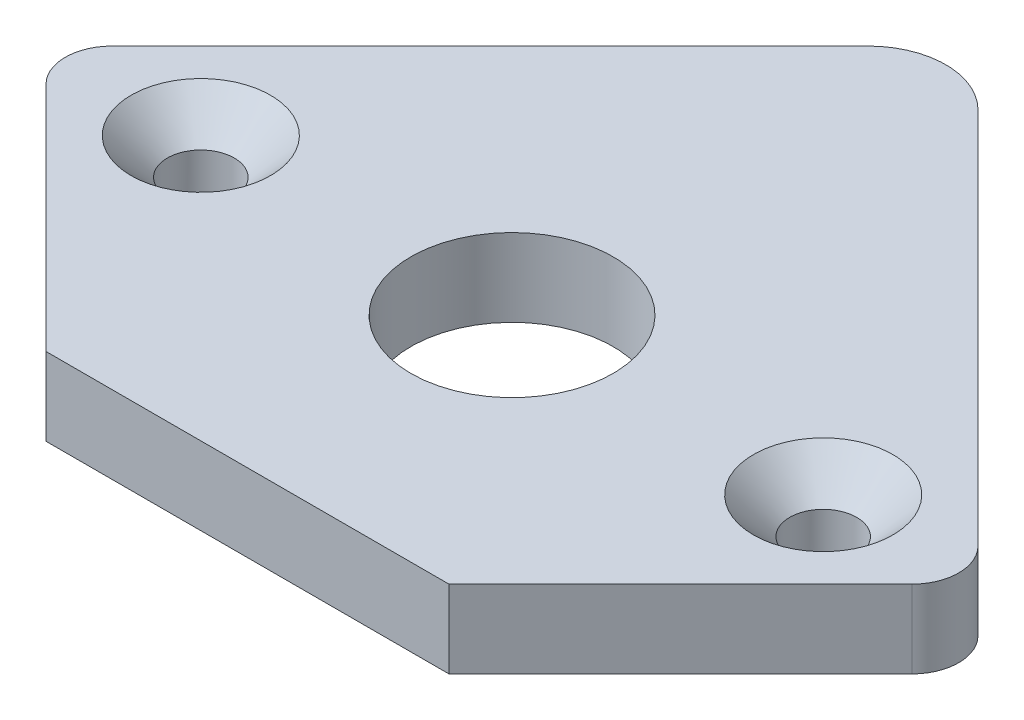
ISO-10303-21;
HEADER;
FILE_DESCRIPTION(('STEP AP214'),'2;1');
FILE_NAME('part.step','',(''),(''),'','','');
FILE_SCHEMA(('AUTOMOTIVE_DESIGN { 1 0 10303 214 1 1 1 1 }'));
ENDSEC;
DATA;
#1=APPLICATION_CONTEXT('core data for automotive mechanical design processes');
#2=APPLICATION_PROTOCOL_DEFINITION('international standard','automotive_design',2000,#1);
#3=PRODUCT_CONTEXT('',#1,'mechanical');
#4=PRODUCT('Part','Part','',(#3));
#5=PRODUCT_RELATED_PRODUCT_CATEGORY('part','',(#4));
#6=PRODUCT_DEFINITION_FORMATION('','',#4);
#7=PRODUCT_DEFINITION_CONTEXT('part definition',#1,'design');
#8=PRODUCT_DEFINITION('design','',#6,#7);
#9=PRODUCT_DEFINITION_SHAPE('','',#8);
#10=(LENGTH_UNIT() NAMED_UNIT(*) SI_UNIT(.MILLI.,.METRE.));
#11=(NAMED_UNIT(*) PLANE_ANGLE_UNIT() SI_UNIT($,.RADIAN.));
#12=(NAMED_UNIT(*) SI_UNIT($,.STERADIAN.) SOLID_ANGLE_UNIT());
#13=UNCERTAINTY_MEASURE_WITH_UNIT(LENGTH_MEASURE(1.E-05),#10,'distance_accuracy_value','');
#14=(GEOMETRIC_REPRESENTATION_CONTEXT(3) GLOBAL_UNCERTAINTY_ASSIGNED_CONTEXT((#13)) GLOBAL_UNIT_ASSIGNED_CONTEXT((#10,
#11,#12)) REPRESENTATION_CONTEXT('',''));
#15=CARTESIAN_POINT('',(0.,0.,0.));
#16=DIRECTION('',(0.,0.,1.));
#17=DIRECTION('',(1.,0.,0.));
#18=AXIS2_PLACEMENT_3D('',#15,#16,#17);
#19=CARTESIAN_POINT('',(-25.7073593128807,2.5,0.));
#20=DIRECTION('',(0.,-1.,0.));
#21=DIRECTION('',(0.,0.,-1.));
#22=AXIS2_PLACEMENT_3D('',#19,#20,#21);
#23=PLANE('',#22);
#24=CARTESIAN_POINT('',(20.,2.5,0.));
#25=DIRECTION('',(0.,1.,0.));
#26=DIRECTION('',(0.,0.,1.));
#27=AXIS2_PLACEMENT_3D('',#24,#25,#26);
#28=CIRCLE('',#27,4.48);
#29=CARTESIAN_POINT('',(20.,2.5,4.48));
#30=VERTEX_POINT('',#29);
#31=EDGE_CURVE('E247',#30,#30,#28,.T.);
#32=ORIENTED_EDGE('',*,*,#31,.F.);
#33=EDGE_LOOP('',(#32));
#34=FACE_BOUND('',#33,.T.);
#35=CARTESIAN_POINT('',(-20.,2.5,0.));
#36=DIRECTION('',(0.,1.,0.));
#37=DIRECTION('',(0.,0.,1.));
#38=AXIS2_PLACEMENT_3D('',#35,#36,#37);
#39=CIRCLE('',#38,4.48);
#40=CARTESIAN_POINT('',(-20.,2.5,4.48));
#41=VERTEX_POINT('',#40);
#42=EDGE_CURVE('E171',#41,#41,#39,.T.);
#43=ORIENTED_EDGE('',*,*,#42,.F.);
#44=EDGE_LOOP('',(#43));
#45=FACE_BOUND('',#44,.T.);
#46=CARTESIAN_POINT('',(-25.7073593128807,2.5,0.));
#47=DIRECTION('',(0.,1.,0.));
#48=DIRECTION('',(0.,0.,-1.));
#49=AXIS2_PLACEMENT_3D('',#46,#47,#48);
#50=CIRCLE('',#49,3.);
#51=CARTESIAN_POINT('',(-27.8286796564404,2.5,-2.12132034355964));
#52=VERTEX_POINT('',#51);
#53=CARTESIAN_POINT('',(-27.8286796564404,2.5,2.12132034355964));
#54=VERTEX_POINT('',#53);
#55=EDGE_CURVE('E151',#52,#54,#50,.T.);
#56=ORIENTED_EDGE('',*,*,#55,.T.);
#57=DIRECTION('',(0.707106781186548,0.,0.707106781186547));
#58=VECTOR('',#57,1.);
#59=CARTESIAN_POINT('',(-12.95,2.5,17.));
#60=LINE('',#59,#58);
#61=CARTESIAN_POINT('',(-12.95,2.5,17.));
#62=VERTEX_POINT('',#61);
#63=EDGE_CURVE('E99',#54,#62,#60,.T.);
#64=ORIENTED_EDGE('',*,*,#63,.T.);
#65=DIRECTION('',(1.,0.,0.));
#66=VECTOR('',#65,1.);
#67=CARTESIAN_POINT('',(12.95,2.5,17.));
#68=LINE('',#67,#66);
#69=CARTESIAN_POINT('',(12.95,2.5,17.));
#70=VERTEX_POINT('',#69);
#71=EDGE_CURVE('E183',#62,#70,#68,.T.);
#72=ORIENTED_EDGE('',*,*,#71,.T.);
#73=DIRECTION('',(0.707106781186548,0.,-0.707106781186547));
#74=VECTOR('',#73,1.);
#75=CARTESIAN_POINT('',(12.95,2.5,17.));
#76=LINE('',#75,#74);
#77=CARTESIAN_POINT('',(27.8286796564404,2.5,2.12132034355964));
#78=VERTEX_POINT('',#77);
#79=EDGE_CURVE('E185',#70,#78,#76,.T.);
#80=ORIENTED_EDGE('',*,*,#79,.T.);
#81=CARTESIAN_POINT('',(25.7073593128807,2.5,0.));
#82=DIRECTION('',(0.,1.,0.));
#83=DIRECTION('',(0.,0.,-1.));
#84=AXIS2_PLACEMENT_3D('',#81,#82,#83);
#85=CIRCLE('',#84,3.);
#86=CARTESIAN_POINT('',(27.8286796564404,2.5,-2.12132034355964));
#87=VERTEX_POINT('',#86);
#88=EDGE_CURVE('E118',#78,#87,#85,.T.);
#89=ORIENTED_EDGE('',*,*,#88,.T.);
#90=DIRECTION('',(-0.707106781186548,0.,-0.707106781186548));
#91=VECTOR('',#90,1.);
#92=CARTESIAN_POINT('',(27.8286796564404,2.5,-2.12132034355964));
#93=LINE('',#92,#91);
#94=CARTESIAN_POINT('',(3.53553390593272,2.5,-26.4144660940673));
#95=VERTEX_POINT('',#94);
#96=EDGE_CURVE('E112',#87,#95,#93,.T.);
#97=ORIENTED_EDGE('',*,*,#96,.T.);
#98=CARTESIAN_POINT('',(0.,2.5,-22.8789321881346));
#99=DIRECTION('',(0.,1.,0.));
#100=DIRECTION('',(0.,0.,-1.));
#101=AXIS2_PLACEMENT_3D('',#98,#99,#100);
#102=CIRCLE('',#101,4.99999999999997);
#103=CARTESIAN_POINT('',(-3.53553390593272,2.5,-26.4144660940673));
#104=VERTEX_POINT('',#103);
#105=EDGE_CURVE('E116',#95,#104,#102,.T.);
#106=ORIENTED_EDGE('',*,*,#105,.T.);
#107=DIRECTION('',(-0.707106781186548,0.,0.707106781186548));
#108=VECTOR('',#107,1.);
#109=CARTESIAN_POINT('',(-27.8286796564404,2.5,-2.12132034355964));
#110=LINE('',#109,#108);
#111=EDGE_CURVE('E56',#104,#52,#110,.T.);
#112=ORIENTED_EDGE('',*,*,#111,.T.);
#113=EDGE_LOOP('',(#56,#64,#72,#80,#89,#97,#106,#112));
#114=FACE_BOUND('',#113,.T.);
#115=CARTESIAN_POINT('',(0.,2.5,0.));
#116=DIRECTION('',(0.,1.,0.));
#117=DIRECTION('',(0.,0.,1.));
#118=AXIS2_PLACEMENT_3D('',#115,#116,#117);
#119=CIRCLE('',#118,6.5);
#120=CARTESIAN_POINT('',(0.,2.5,6.5));
#121=VERTEX_POINT('',#120);
#122=EDGE_CURVE('E140',#121,#121,#119,.T.);
#123=ORIENTED_EDGE('',*,*,#122,.F.);
#124=EDGE_LOOP('',(#123));
#125=FACE_BOUND('',#124,.T.);
#126=ADVANCED_FACE('F37',(#34,#45,#114,#125),#23,.F.);
#127=CARTESIAN_POINT('',(-25.7073593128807,-2.5,0.));
#128=DIRECTION('',(0.,-1.,0.));
#129=DIRECTION('',(0.,0.,-1.));
#130=AXIS2_PLACEMENT_3D('',#127,#128,#129);
#131=PLANE('',#130);
#132=CARTESIAN_POINT('',(20.,-2.5,0.));
#133=DIRECTION('',(0.,-1.,0.));
#134=DIRECTION('',(0.,0.,-1.));
#135=AXIS2_PLACEMENT_3D('',#132,#133,#134);
#136=CIRCLE('',#135,2.14999999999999);
#137=CARTESIAN_POINT('',(20.,-2.5,-2.14999999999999));
#138=VERTEX_POINT('',#137);
#139=EDGE_CURVE('E41',#138,#138,#136,.T.);
#140=ORIENTED_EDGE('',*,*,#139,.F.);
#141=EDGE_LOOP('',(#140));
#142=FACE_BOUND('',#141,.T.);
#143=CARTESIAN_POINT('',(-20.,-2.5,0.));
#144=DIRECTION('',(0.,-1.,0.));
#145=DIRECTION('',(0.,0.,-1.));
#146=AXIS2_PLACEMENT_3D('',#143,#144,#145);
#147=CIRCLE('',#146,2.14999999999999);
#148=CARTESIAN_POINT('',(-20.,-2.5,-2.14999999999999));
#149=VERTEX_POINT('',#148);
#150=EDGE_CURVE('E162',#149,#149,#147,.T.);
#151=ORIENTED_EDGE('',*,*,#150,.F.);
#152=EDGE_LOOP('',(#151));
#153=FACE_BOUND('',#152,.T.);
#154=CARTESIAN_POINT('',(-25.7073593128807,-2.5,0.));
#155=DIRECTION('',(0.,1.,0.));
#156=DIRECTION('',(0.,0.,-1.));
#157=AXIS2_PLACEMENT_3D('',#154,#155,#156);
#158=CIRCLE('',#157,3.);
#159=CARTESIAN_POINT('',(-27.8286796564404,-2.5,-2.12132034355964));
#160=VERTEX_POINT('',#159);
#161=CARTESIAN_POINT('',(-27.8286796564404,-2.5,2.12132034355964));
#162=VERTEX_POINT('',#161);
#163=EDGE_CURVE('E136',#160,#162,#158,.T.);
#164=ORIENTED_EDGE('',*,*,#163,.F.);
#165=DIRECTION('',(-0.707106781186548,0.,0.707106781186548));
#166=VECTOR('',#165,1.);
#167=CARTESIAN_POINT('',(-27.8286796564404,-2.5,-2.12132034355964));
#168=LINE('',#167,#166);
#169=CARTESIAN_POINT('',(-3.53553390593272,-2.5,-26.4144660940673));
#170=VERTEX_POINT('',#169);
#171=EDGE_CURVE('E91',#170,#160,#168,.T.);
#172=ORIENTED_EDGE('',*,*,#171,.F.);
#173=CARTESIAN_POINT('',(0.,-2.5,-22.8789321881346));
#174=DIRECTION('',(0.,1.,0.));
#175=DIRECTION('',(0.,0.,-1.));
#176=AXIS2_PLACEMENT_3D('',#173,#174,#175);
#177=CIRCLE('',#176,4.99999999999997);
#178=CARTESIAN_POINT('',(3.53553390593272,-2.5,-26.4144660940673));
#179=VERTEX_POINT('',#178);
#180=EDGE_CURVE('E85',#179,#170,#177,.T.);
#181=ORIENTED_EDGE('',*,*,#180,.F.);
#182=DIRECTION('',(-0.707106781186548,0.,-0.707106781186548));
#183=VECTOR('',#182,1.);
#184=CARTESIAN_POINT('',(27.8286796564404,-2.5,-2.12132034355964));
#185=LINE('',#184,#183);
#186=CARTESIAN_POINT('',(27.8286796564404,-2.5,-2.12132034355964));
#187=VERTEX_POINT('',#186);
#188=EDGE_CURVE('E126',#187,#179,#185,.T.);
#189=ORIENTED_EDGE('',*,*,#188,.F.);
#190=CARTESIAN_POINT('',(25.7073593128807,-2.5,0.));
#191=DIRECTION('',(0.,1.,0.));
#192=DIRECTION('',(0.,0.,-1.));
#193=AXIS2_PLACEMENT_3D('',#190,#191,#192);
#194=CIRCLE('',#193,3.);
#195=CARTESIAN_POINT('',(27.8286796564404,-2.5,2.12132034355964));
#196=VERTEX_POINT('',#195);
#197=EDGE_CURVE('E146',#196,#187,#194,.T.);
#198=ORIENTED_EDGE('',*,*,#197,.F.);
#199=DIRECTION('',(0.707106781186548,0.,-0.707106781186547));
#200=VECTOR('',#199,1.);
#201=CARTESIAN_POINT('',(12.95,-2.5,17.));
#202=LINE('',#201,#200);
#203=CARTESIAN_POINT('',(12.95,-2.5,17.));
#204=VERTEX_POINT('',#203);
#205=EDGE_CURVE('E144',#204,#196,#202,.T.);
#206=ORIENTED_EDGE('',*,*,#205,.F.);
#207=DIRECTION('',(1.,0.,0.));
#208=VECTOR('',#207,1.);
#209=CARTESIAN_POINT('',(12.95,-2.5,17.));
#210=LINE('',#209,#208);
#211=CARTESIAN_POINT('',(-12.95,-2.5,17.));
#212=VERTEX_POINT('',#211);
#213=EDGE_CURVE('E142',#212,#204,#210,.T.);
#214=ORIENTED_EDGE('',*,*,#213,.F.);
#215=DIRECTION('',(0.707106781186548,0.,0.707106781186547));
#216=VECTOR('',#215,1.);
#217=CARTESIAN_POINT('',(-12.95,-2.5,17.));
#218=LINE('',#217,#216);
#219=EDGE_CURVE('E139',#162,#212,#218,.T.);
#220=ORIENTED_EDGE('',*,*,#219,.F.);
#221=EDGE_LOOP('',(#164,#172,#181,#189,#198,#206,#214,#220));
#222=FACE_BOUND('',#221,.T.);
#223=CARTESIAN_POINT('',(0.,-2.5,0.));
#224=DIRECTION('',(0.,1.,0.));
#225=DIRECTION('',(0.,0.,1.));
#226=AXIS2_PLACEMENT_3D('',#223,#224,#225);
#227=CIRCLE('',#226,6.5);
#228=CARTESIAN_POINT('',(0.,-2.5,6.5));
#229=VERTEX_POINT('',#228);
#230=EDGE_CURVE('E164',#229,#229,#227,.T.);
#231=ORIENTED_EDGE('',*,*,#230,.T.);
#232=EDGE_LOOP('',(#231));
#233=FACE_BOUND('',#232,.T.);
#234=ADVANCED_FACE('F198',(#142,#153,#222,#233),#131,.T.);
#235=CARTESIAN_POINT('',(-25.7073593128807,2.5,0.));
#236=DIRECTION('',(0.,-1.,0.));
#237=DIRECTION('',(0.,0.,-1.));
#238=AXIS2_PLACEMENT_3D('',#235,#236,#237);
#239=CYLINDRICAL_SURFACE('',#238,3.);
#240=ORIENTED_EDGE('',*,*,#163,.T.);
#241=DIRECTION('',(0.,-1.,0.));
#242=VECTOR('',#241,1.);
#243=CARTESIAN_POINT('',(-27.8286796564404,2.5,2.12132034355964));
#244=LINE('',#243,#242);
#245=EDGE_CURVE('E11',#54,#162,#244,.T.);
#246=ORIENTED_EDGE('',*,*,#245,.F.);
#247=ORIENTED_EDGE('',*,*,#55,.F.);
#248=DIRECTION('',(0.,-1.,0.));
#249=VECTOR('',#248,1.);
#250=CARTESIAN_POINT('',(-27.8286796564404,2.5,-2.12132034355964));
#251=LINE('',#250,#249);
#252=EDGE_CURVE('E132',#52,#160,#251,.T.);
#253=ORIENTED_EDGE('',*,*,#252,.T.);
#254=EDGE_LOOP('',(#240,#246,#247,#253));
#255=FACE_BOUND('',#254,.T.);
#256=ADVANCED_FACE('F39',(#255),#239,.T.);
#257=CARTESIAN_POINT('',(-12.95,2.5,17.));
#258=DIRECTION('',(0.707106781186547,0.,-0.707106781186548));
#259=DIRECTION('',(-0.707106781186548,0.,-0.707106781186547));
#260=AXIS2_PLACEMENT_3D('',#257,#258,#259);
#261=PLANE('',#260);
#262=ORIENTED_EDGE('',*,*,#219,.T.);
#263=DIRECTION('',(0.,-1.,0.));
#264=VECTOR('',#263,1.);
#265=CARTESIAN_POINT('',(-12.95,2.5,17.));
#266=LINE('',#265,#264);
#267=EDGE_CURVE('E47',#62,#212,#266,.T.);
#268=ORIENTED_EDGE('',*,*,#267,.F.);
#269=ORIENTED_EDGE('',*,*,#63,.F.);
#270=ORIENTED_EDGE('',*,*,#245,.T.);
#271=EDGE_LOOP('',(#262,#268,#269,#270));
#272=FACE_BOUND('',#271,.T.);
#273=ADVANCED_FACE('F279',(#272),#261,.F.);
#274=CARTESIAN_POINT('',(12.95,2.5,17.));
#275=DIRECTION('',(0.,0.,-1.));
#276=DIRECTION('',(-1.,0.,0.));
#277=AXIS2_PLACEMENT_3D('',#274,#275,#276);
#278=PLANE('',#277);
#279=ORIENTED_EDGE('',*,*,#213,.T.);
#280=DIRECTION('',(0.,-1.,0.));
#281=VECTOR('',#280,1.);
#282=CARTESIAN_POINT('',(12.95,2.5,17.));
#283=LINE('',#282,#281);
#284=EDGE_CURVE('E158',#70,#204,#283,.T.);
#285=ORIENTED_EDGE('',*,*,#284,.F.);
#286=ORIENTED_EDGE('',*,*,#71,.F.);
#287=ORIENTED_EDGE('',*,*,#267,.T.);
#288=EDGE_LOOP('',(#279,#285,#286,#287));
#289=FACE_BOUND('',#288,.T.);
#290=ADVANCED_FACE('F285',(#289),#278,.F.);
#291=CARTESIAN_POINT('',(12.95,2.5,17.));
#292=DIRECTION('',(-0.707106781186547,0.,-0.707106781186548));
#293=DIRECTION('',(-0.707106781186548,0.,0.707106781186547));
#294=AXIS2_PLACEMENT_3D('',#291,#292,#293);
#295=PLANE('',#294);
#296=ORIENTED_EDGE('',*,*,#205,.T.);
#297=DIRECTION('',(0.,-1.,0.));
#298=VECTOR('',#297,1.);
#299=CARTESIAN_POINT('',(27.8286796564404,2.5,2.12132034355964));
#300=LINE('',#299,#298);
#301=EDGE_CURVE('E155',#78,#196,#300,.T.);
#302=ORIENTED_EDGE('',*,*,#301,.F.);
#303=ORIENTED_EDGE('',*,*,#79,.F.);
#304=ORIENTED_EDGE('',*,*,#284,.T.);
#305=EDGE_LOOP('',(#296,#302,#303,#304));
#306=FACE_BOUND('',#305,.T.);
#307=ADVANCED_FACE('F191',(#306),#295,.F.);
#308=CARTESIAN_POINT('',(25.7073593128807,2.5,0.));
#309=DIRECTION('',(0.,-1.,0.));
#310=DIRECTION('',(0.,0.,-1.));
#311=AXIS2_PLACEMENT_3D('',#308,#309,#310);
#312=CYLINDRICAL_SURFACE('',#311,3.);
#313=ORIENTED_EDGE('',*,*,#197,.T.);
#314=DIRECTION('',(0.,-1.,0.));
#315=VECTOR('',#314,1.);
#316=CARTESIAN_POINT('',(27.8286796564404,2.5,-2.12132034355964));
#317=LINE('',#316,#315);
#318=EDGE_CURVE('E127',#87,#187,#317,.T.);
#319=ORIENTED_EDGE('',*,*,#318,.F.);
#320=ORIENTED_EDGE('',*,*,#88,.F.);
#321=ORIENTED_EDGE('',*,*,#301,.T.);
#322=EDGE_LOOP('',(#313,#319,#320,#321));
#323=FACE_BOUND('',#322,.T.);
#324=ADVANCED_FACE('F195',(#323),#312,.T.);
#325=CARTESIAN_POINT('',(27.8286796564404,2.5,-2.12132034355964));
#326=DIRECTION('',(-0.707106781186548,0.,0.707106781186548));
#327=DIRECTION('',(0.707106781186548,0.,0.707106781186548));
#328=AXIS2_PLACEMENT_3D('',#325,#326,#327);
#329=PLANE('',#328);
#330=ORIENTED_EDGE('',*,*,#188,.T.);
#331=DIRECTION('',(0.,-1.,0.));
#332=VECTOR('',#331,1.);
#333=CARTESIAN_POINT('',(3.53553390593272,2.5,-26.4144660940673));
#334=LINE('',#333,#332);
#335=EDGE_CURVE('E123',#95,#179,#334,.T.);
#336=ORIENTED_EDGE('',*,*,#335,.F.);
#337=ORIENTED_EDGE('',*,*,#96,.F.);
#338=ORIENTED_EDGE('',*,*,#318,.T.);
#339=EDGE_LOOP('',(#330,#336,#337,#338));
#340=FACE_BOUND('',#339,.T.);
#341=ADVANCED_FACE('F124',(#340),#329,.F.);
#342=CARTESIAN_POINT('',(0.,2.5,-22.8789321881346));
#343=DIRECTION('',(0.,-1.,0.));
#344=DIRECTION('',(0.,0.,-1.));
#345=AXIS2_PLACEMENT_3D('',#342,#343,#344);
#346=CYLINDRICAL_SURFACE('',#345,4.99999999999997);
#347=ORIENTED_EDGE('',*,*,#180,.T.);
#348=DIRECTION('',(0.,-1.,0.));
#349=VECTOR('',#348,1.);
#350=CARTESIAN_POINT('',(-3.53553390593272,2.5,-26.4144660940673));
#351=LINE('',#350,#349);
#352=EDGE_CURVE('E128',#104,#170,#351,.T.);
#353=ORIENTED_EDGE('',*,*,#352,.F.);
#354=ORIENTED_EDGE('',*,*,#105,.F.);
#355=ORIENTED_EDGE('',*,*,#335,.T.);
#356=EDGE_LOOP('',(#347,#353,#354,#355));
#357=FACE_BOUND('',#356,.T.);
#358=ADVANCED_FACE('F130',(#357),#346,.T.);
#359=CARTESIAN_POINT('',(-27.8286796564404,2.5,-2.12132034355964));
#360=DIRECTION('',(0.707106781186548,0.,0.707106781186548));
#361=DIRECTION('',(0.707106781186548,0.,-0.707106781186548));
#362=AXIS2_PLACEMENT_3D('',#359,#360,#361);
#363=PLANE('',#362);
#364=ORIENTED_EDGE('',*,*,#171,.T.);
#365=ORIENTED_EDGE('',*,*,#252,.F.);
#366=ORIENTED_EDGE('',*,*,#111,.F.);
#367=ORIENTED_EDGE('',*,*,#352,.T.);
#368=EDGE_LOOP('',(#364,#365,#366,#367));
#369=FACE_BOUND('',#368,.T.);
#370=ADVANCED_FACE('F204',(#369),#363,.F.);
#371=CARTESIAN_POINT('',(0.,2.5,0.));
#372=DIRECTION('',(0.,-1.,0.));
#373=DIRECTION('',(0.,0.,-1.));
#374=AXIS2_PLACEMENT_3D('',#371,#372,#373);
#375=CYLINDRICAL_SURFACE('',#374,6.5);
#376=ORIENTED_EDGE('',*,*,#122,.T.);
#377=EDGE_LOOP('',(#376));
#378=FACE_BOUND('',#377,.T.);
#379=ORIENTED_EDGE('',*,*,#230,.F.);
#380=EDGE_LOOP('',(#379));
#381=FACE_BOUND('',#380,.T.);
#382=ADVANCED_FACE('F206',(#378,#381),#375,.F.);
#383=CARTESIAN_POINT('',(-20.,2.5,0.));
#384=DIRECTION('',(0.,1.,0.));
#385=DIRECTION('',(0.,0.,1.));
#386=AXIS2_PLACEMENT_3D('',#383,#384,#385);
#387=CYLINDRICAL_SURFACE('',#386,2.14999999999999);
#388=ORIENTED_EDGE('',*,*,#150,.T.);
#389=EDGE_LOOP('',(#388));
#390=FACE_BOUND('',#389,.T.);
#391=CARTESIAN_POINT('',(-20.,0.170000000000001,0.));
#392=DIRECTION('',(0.,1.,0.));
#393=DIRECTION('',(0.,0.,1.));
#394=AXIS2_PLACEMENT_3D('',#391,#392,#393);
#395=CIRCLE('',#394,2.14999999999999);
#396=CARTESIAN_POINT('',(-20.,0.170000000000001,2.14999999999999));
#397=VERTEX_POINT('',#396);
#398=EDGE_CURVE('E165',#397,#397,#395,.T.);
#399=ORIENTED_EDGE('',*,*,#398,.T.);
#400=EDGE_LOOP('',(#399));
#401=FACE_BOUND('',#400,.T.);
#402=ADVANCED_FACE('F212',(#390,#401),#387,.F.);
#403=CARTESIAN_POINT('',(-20.,2.5,0.));
#404=DIRECTION('',(0.,1.,0.));
#405=DIRECTION('',(0.,0.,1.));
#406=AXIS2_PLACEMENT_3D('',#403,#404,#405);
#407=CONICAL_SURFACE('',#406,4.48,0.785398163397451);
#408=ORIENTED_EDGE('',*,*,#398,.F.);
#409=EDGE_LOOP('',(#408));
#410=FACE_BOUND('',#409,.T.);
#411=ORIENTED_EDGE('',*,*,#42,.T.);
#412=EDGE_LOOP('',(#411));
#413=FACE_BOUND('',#412,.T.);
#414=ADVANCED_FACE('F229',(#410,#413),#407,.F.);
#415=CARTESIAN_POINT('',(20.,2.5,0.));
#416=DIRECTION('',(0.,1.,0.));
#417=DIRECTION('',(0.,0.,1.));
#418=AXIS2_PLACEMENT_3D('',#415,#416,#417);
#419=CYLINDRICAL_SURFACE('',#418,2.14999999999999);
#420=ORIENTED_EDGE('',*,*,#139,.T.);
#421=EDGE_LOOP('',(#420));
#422=FACE_BOUND('',#421,.T.);
#423=CARTESIAN_POINT('',(20.,0.170000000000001,0.));
#424=DIRECTION('',(0.,1.,0.));
#425=DIRECTION('',(0.,0.,1.));
#426=AXIS2_PLACEMENT_3D('',#423,#424,#425);
#427=CIRCLE('',#426,2.14999999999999);
#428=CARTESIAN_POINT('',(20.,0.170000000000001,2.14999999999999));
#429=VERTEX_POINT('',#428);
#430=EDGE_CURVE('E245',#429,#429,#427,.T.);
#431=ORIENTED_EDGE('',*,*,#430,.T.);
#432=EDGE_LOOP('',(#431));
#433=FACE_BOUND('',#432,.T.);
#434=ADVANCED_FACE('F232',(#422,#433),#419,.F.);
#435=CARTESIAN_POINT('',(20.,2.5,0.));
#436=DIRECTION('',(0.,1.,0.));
#437=DIRECTION('',(0.,0.,1.));
#438=AXIS2_PLACEMENT_3D('',#435,#436,#437);
#439=CONICAL_SURFACE('',#438,4.48,0.785398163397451);
#440=ORIENTED_EDGE('',*,*,#430,.F.);
#441=EDGE_LOOP('',(#440));
#442=FACE_BOUND('',#441,.T.);
#443=ORIENTED_EDGE('',*,*,#31,.T.);
#444=EDGE_LOOP('',(#443));
#445=FACE_BOUND('',#444,.T.);
#446=ADVANCED_FACE('F236',(#442,#445),#439,.F.);
#447=CLOSED_SHELL('',(#126,#234,#256,#273,#290,#307,#324,#341,#358,#370,#382,#402,#414,#434,#446));
#448=MANIFOLD_SOLID_BREP('B2',#447);
#449=ADVANCED_BREP_SHAPE_REPRESENTATION('',(#18,#448),#14);
#450=SHAPE_DEFINITION_REPRESENTATION(#9,#449);
ENDSEC;
END-ISO-10303-21;
